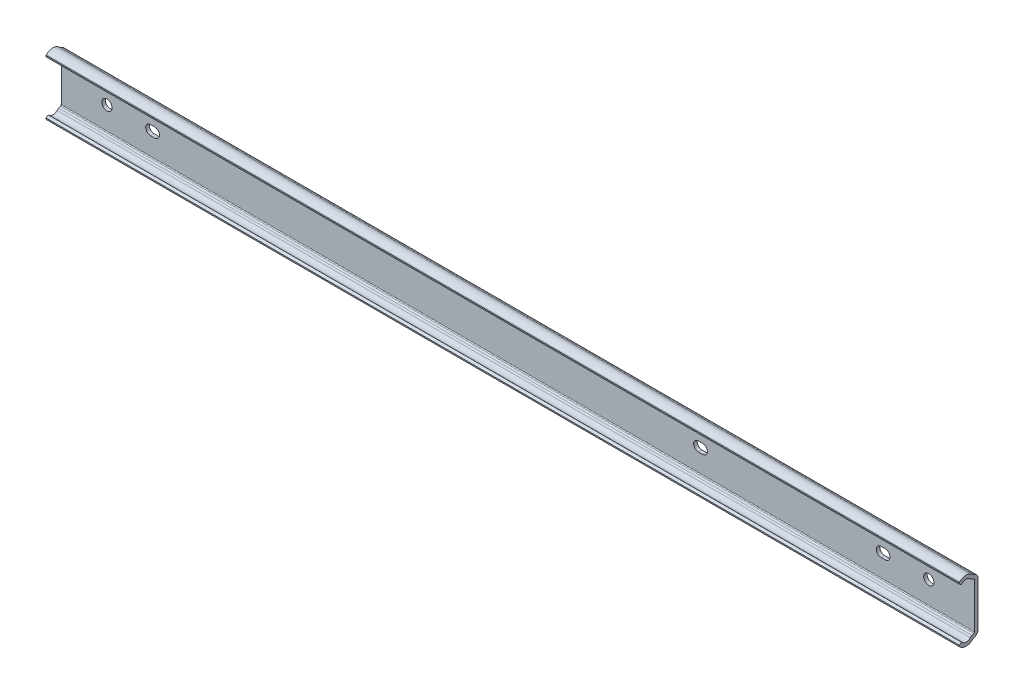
ISO-10303-21;
HEADER;
FILE_DESCRIPTION(('STEP AP214'),'2;1');
FILE_NAME('part.step','',(''),(''),'','','');
FILE_SCHEMA(('AUTOMOTIVE_DESIGN { 1 0 10303 214 1 1 1 1 }'));
ENDSEC;
DATA;
#1=APPLICATION_CONTEXT('core data for automotive mechanical design processes');
#2=APPLICATION_PROTOCOL_DEFINITION('international standard','automotive_design',2000,#1);
#3=PRODUCT_CONTEXT('',#1,'mechanical');
#4=PRODUCT('Part','Part','',(#3));
#5=PRODUCT_RELATED_PRODUCT_CATEGORY('part','',(#4));
#6=PRODUCT_DEFINITION_FORMATION('','',#4);
#7=PRODUCT_DEFINITION_CONTEXT('part definition',#1,'design');
#8=PRODUCT_DEFINITION('design','',#6,#7);
#9=PRODUCT_DEFINITION_SHAPE('','',#8);
#10=(LENGTH_UNIT() NAMED_UNIT(*) SI_UNIT(.MILLI.,.METRE.));
#11=(NAMED_UNIT(*) PLANE_ANGLE_UNIT() SI_UNIT($,.RADIAN.));
#12=(NAMED_UNIT(*) SI_UNIT($,.STERADIAN.) SOLID_ANGLE_UNIT());
#13=UNCERTAINTY_MEASURE_WITH_UNIT(LENGTH_MEASURE(1.E-05),#10,'distance_accuracy_value','');
#14=(GEOMETRIC_REPRESENTATION_CONTEXT(3) GLOBAL_UNCERTAINTY_ASSIGNED_CONTEXT((#13)) GLOBAL_UNIT_ASSIGNED_CONTEXT((#10,
#11,#12)) REPRESENTATION_CONTEXT('',''));
#15=CARTESIAN_POINT('',(0.,0.,0.));
#16=DIRECTION('',(0.,0.,1.));
#17=DIRECTION('',(1.,0.,0.));
#18=AXIS2_PLACEMENT_3D('',#15,#16,#17);
#19=CARTESIAN_POINT('',(-20.,9.85313395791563,1.54999999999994));
#20=DIRECTION('',(0.,0.,1.));
#21=DIRECTION('',(-1.,0.,0.));
#22=AXIS2_PLACEMENT_3D('',#19,#20,#21);
#23=PLANE('',#22);
#24=DIRECTION('',(0.,-1.,0.));
#25=VECTOR('',#24,1.);
#26=CARTESIAN_POINT('',(-20.,9.85313395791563,1.54999999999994));
#27=LINE('',#26,#25);
#28=CARTESIAN_POINT('',(-20.,9.85313395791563,1.54999999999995));
#29=VERTEX_POINT('',#28);
#30=CARTESIAN_POINT('',(-20.,-9.85313395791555,1.54999999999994));
#31=VERTEX_POINT('',#30);
#32=EDGE_CURVE('E510',#29,#31,#27,.T.);
#33=ORIENTED_EDGE('',*,*,#32,.T.);
#34=DIRECTION('',(1.,0.,0.));
#35=VECTOR('',#34,1.);
#36=CARTESIAN_POINT('',(-20.,-9.85313395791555,1.54999999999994));
#37=LINE('',#36,#35);
#38=CARTESIAN_POINT('',(380.,-9.85313395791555,1.54999999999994));
#39=VERTEX_POINT('',#38);
#40=EDGE_CURVE('E524',#31,#39,#37,.T.);
#41=ORIENTED_EDGE('',*,*,#40,.T.);
#42=DIRECTION('',(0.,-1.,0.));
#43=VECTOR('',#42,1.);
#44=CARTESIAN_POINT('',(380.,9.85313395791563,1.54999999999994));
#45=LINE('',#44,#43);
#46=CARTESIAN_POINT('',(380.,9.85313395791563,1.54999999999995));
#47=VERTEX_POINT('',#46);
#48=EDGE_CURVE('E435',#47,#39,#45,.T.);
#49=ORIENTED_EDGE('',*,*,#48,.F.);
#50=DIRECTION('',(1.,0.,0.));
#51=VECTOR('',#50,1.);
#52=CARTESIAN_POINT('',(-20.,9.85313395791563,1.54999999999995));
#53=LINE('',#52,#51);
#54=EDGE_CURVE('E526',#29,#47,#53,.T.);
#55=ORIENTED_EDGE('',*,*,#54,.F.);
#56=EDGE_LOOP('',(#33,#41,#49,#55));
#57=FACE_BOUND('',#56,.T.);
#58=CARTESIAN_POINT('',(20.9,0.,1.54999999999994));
#59=DIRECTION('',(0.,0.,1.));
#60=DIRECTION('',(-1.,0.,0.));
#61=AXIS2_PLACEMENT_3D('',#58,#59,#60);
#62=CIRCLE('',#61,2.1);
#63=CARTESIAN_POINT('',(20.9,-2.1,1.54999999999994));
#64=VERTEX_POINT('',#63);
#65=CARTESIAN_POINT('',(20.9,2.1,1.54999999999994));
#66=VERTEX_POINT('',#65);
#67=EDGE_CURVE('E31',#64,#66,#62,.T.);
#68=ORIENTED_EDGE('',*,*,#67,.F.);
#69=DIRECTION('',(1.,0.,0.));
#70=VECTOR('',#69,1.);
#71=CARTESIAN_POINT('',(20.9,-2.1,1.54999999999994));
#72=LINE('',#71,#70);
#73=CARTESIAN_POINT('',(19.1,-2.1,1.54999999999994));
#74=VERTEX_POINT('',#73);
#75=EDGE_CURVE('E277',#74,#64,#72,.T.);
#76=ORIENTED_EDGE('',*,*,#75,.F.);
#77=CARTESIAN_POINT('',(19.1,0.,1.54999999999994));
#78=DIRECTION('',(0.,0.,1.));
#79=DIRECTION('',(-1.,0.,0.));
#80=AXIS2_PLACEMENT_3D('',#77,#78,#79);
#81=CIRCLE('',#80,2.1);
#82=CARTESIAN_POINT('',(19.1,2.1,1.54999999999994));
#83=VERTEX_POINT('',#82);
#84=EDGE_CURVE('E262',#83,#74,#81,.T.);
#85=ORIENTED_EDGE('',*,*,#84,.F.);
#86=DIRECTION('',(-1.,0.,0.));
#87=VECTOR('',#86,1.);
#88=CARTESIAN_POINT('',(20.9,2.1,1.54999999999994));
#89=LINE('',#88,#87);
#90=EDGE_CURVE('E271',#66,#83,#89,.T.);
#91=ORIENTED_EDGE('',*,*,#90,.F.);
#92=EDGE_LOOP('',(#68,#76,#85,#91));
#93=FACE_BOUND('',#92,.T.);
#94=CARTESIAN_POINT('',(260.9,0.,1.54999999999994));
#95=DIRECTION('',(0.,0.,1.));
#96=DIRECTION('',(-1.,0.,0.));
#97=AXIS2_PLACEMENT_3D('',#94,#95,#96);
#98=CIRCLE('',#97,2.1);
#99=CARTESIAN_POINT('',(260.9,-2.09999999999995,1.54999999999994));
#100=VERTEX_POINT('',#99);
#101=CARTESIAN_POINT('',(260.9,2.10000000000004,1.54999999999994));
#102=VERTEX_POINT('',#101);
#103=EDGE_CURVE('E293',#100,#102,#98,.T.);
#104=ORIENTED_EDGE('',*,*,#103,.F.);
#105=DIRECTION('',(1.,0.,0.));
#106=VECTOR('',#105,1.);
#107=CARTESIAN_POINT('',(260.9,-2.09999999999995,1.54999999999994));
#108=LINE('',#107,#106);
#109=CARTESIAN_POINT('',(259.1,-2.09999999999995,1.54999999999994));
#110=VERTEX_POINT('',#109);
#111=EDGE_CURVE('E303',#110,#100,#108,.T.);
#112=ORIENTED_EDGE('',*,*,#111,.F.);
#113=CARTESIAN_POINT('',(259.1,0.,1.54999999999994));
#114=DIRECTION('',(0.,0.,1.));
#115=DIRECTION('',(-1.,0.,0.));
#116=AXIS2_PLACEMENT_3D('',#113,#114,#115);
#117=CIRCLE('',#116,2.1);
#118=CARTESIAN_POINT('',(259.1,2.10000000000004,1.54999999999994));
#119=VERTEX_POINT('',#118);
#120=EDGE_CURVE('E300',#119,#110,#117,.T.);
#121=ORIENTED_EDGE('',*,*,#120,.F.);
#122=DIRECTION('',(-1.,0.,0.));
#123=VECTOR('',#122,1.);
#124=CARTESIAN_POINT('',(260.9,2.10000000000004,1.54999999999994));
#125=LINE('',#124,#123);
#126=EDGE_CURVE('E297',#102,#119,#125,.T.);
#127=ORIENTED_EDGE('',*,*,#126,.F.);
#128=EDGE_LOOP('',(#104,#112,#121,#127));
#129=FACE_BOUND('',#128,.T.);
#130=CARTESIAN_POINT('',(360.,0.,1.54999999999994));
#131=DIRECTION('',(0.,0.,1.));
#132=DIRECTION('',(-1.,0.,0.));
#133=AXIS2_PLACEMENT_3D('',#130,#131,#132);
#134=CIRCLE('',#133,2.24999999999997);
#135=CARTESIAN_POINT('',(357.75,0.,1.54999999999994));
#136=VERTEX_POINT('',#135);
#137=EDGE_CURVE('E321',#136,#136,#134,.T.);
#138=ORIENTED_EDGE('',*,*,#137,.F.);
#139=EDGE_LOOP('',(#138));
#140=FACE_BOUND('',#139,.T.);
#141=CARTESIAN_POINT('',(0.,0.,1.54999999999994));
#142=DIRECTION('',(0.,0.,1.));
#143=DIRECTION('',(-1.,0.,0.));
#144=AXIS2_PLACEMENT_3D('',#141,#142,#143);
#145=CIRCLE('',#144,2.24999999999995);
#146=CARTESIAN_POINT('',(-2.24999999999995,0.,1.54999999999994));
#147=VERTEX_POINT('',#146);
#148=EDGE_CURVE('E333',#147,#147,#145,.T.);
#149=ORIENTED_EDGE('',*,*,#148,.F.);
#150=EDGE_LOOP('',(#149));
#151=FACE_BOUND('',#150,.T.);
#152=CARTESIAN_POINT('',(339.1,0.,1.54999999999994));
#153=DIRECTION('',(0.,0.,1.));
#154=DIRECTION('',(-1.,0.,0.));
#155=AXIS2_PLACEMENT_3D('',#152,#153,#154);
#156=CIRCLE('',#155,2.1);
#157=CARTESIAN_POINT('',(339.1,2.10000000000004,1.54999999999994));
#158=VERTEX_POINT('',#157);
#159=CARTESIAN_POINT('',(339.1,-2.09999999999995,1.54999999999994));
#160=VERTEX_POINT('',#159);
#161=EDGE_CURVE('E339',#158,#160,#156,.T.);
#162=ORIENTED_EDGE('',*,*,#161,.F.);
#163=DIRECTION('',(-1.,0.,0.));
#164=VECTOR('',#163,1.);
#165=CARTESIAN_POINT('',(340.9,2.10000000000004,1.54999999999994));
#166=LINE('',#165,#164);
#167=CARTESIAN_POINT('',(340.9,2.10000000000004,1.54999999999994));
#168=VERTEX_POINT('',#167);
#169=EDGE_CURVE('E347',#168,#158,#166,.T.);
#170=ORIENTED_EDGE('',*,*,#169,.F.);
#171=CARTESIAN_POINT('',(340.9,0.,1.54999999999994));
#172=DIRECTION('',(0.,0.,1.));
#173=DIRECTION('',(-1.,0.,0.));
#174=AXIS2_PLACEMENT_3D('',#171,#172,#173);
#175=CIRCLE('',#174,2.1);
#176=CARTESIAN_POINT('',(340.9,-2.09999999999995,1.54999999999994));
#177=VERTEX_POINT('',#176);
#178=EDGE_CURVE('E344',#177,#168,#175,.T.);
#179=ORIENTED_EDGE('',*,*,#178,.F.);
#180=DIRECTION('',(1.,0.,0.));
#181=VECTOR('',#180,1.);
#182=CARTESIAN_POINT('',(340.9,-2.09999999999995,1.54999999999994));
#183=LINE('',#182,#181);
#184=EDGE_CURVE('E341',#160,#177,#183,.T.);
#185=ORIENTED_EDGE('',*,*,#184,.F.);
#186=EDGE_LOOP('',(#162,#170,#179,#185));
#187=FACE_BOUND('',#186,.T.);
#188=ADVANCED_FACE('F14',(#57,#93,#129,#140,#151,#187),#23,.T.);
#189=CARTESIAN_POINT('',(-20.,9.85313395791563,0.));
#190=DIRECTION('',(0.,0.,-1.));
#191=DIRECTION('',(1.,0.,0.));
#192=AXIS2_PLACEMENT_3D('',#189,#190,#191);
#193=PLANE('',#192);
#194=DIRECTION('',(0.,1.,0.));
#195=VECTOR('',#194,1.);
#196=CARTESIAN_POINT('',(-20.,9.85313395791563,0.));
#197=LINE('',#196,#195);
#198=CARTESIAN_POINT('',(-20.,-9.85313395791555,0.));
#199=VERTEX_POINT('',#198);
#200=CARTESIAN_POINT('',(-20.,9.85313395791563,0.));
#201=VERTEX_POINT('',#200);
#202=EDGE_CURVE('E473',#199,#201,#197,.T.);
#203=ORIENTED_EDGE('',*,*,#202,.T.);
#204=DIRECTION('',(1.,0.,0.));
#205=VECTOR('',#204,1.);
#206=CARTESIAN_POINT('',(-20.,9.85313395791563,0.));
#207=LINE('',#206,#205);
#208=CARTESIAN_POINT('',(380.,9.85313395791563,0.));
#209=VERTEX_POINT('',#208);
#210=EDGE_CURVE('E551',#201,#209,#207,.T.);
#211=ORIENTED_EDGE('',*,*,#210,.T.);
#212=DIRECTION('',(0.,1.,0.));
#213=VECTOR('',#212,1.);
#214=CARTESIAN_POINT('',(380.,9.85313395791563,0.));
#215=LINE('',#214,#213);
#216=CARTESIAN_POINT('',(380.,-9.85313395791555,0.));
#217=VERTEX_POINT('',#216);
#218=EDGE_CURVE('E397',#217,#209,#215,.T.);
#219=ORIENTED_EDGE('',*,*,#218,.F.);
#220=DIRECTION('',(1.,0.,0.));
#221=VECTOR('',#220,1.);
#222=CARTESIAN_POINT('',(-20.,-9.85313395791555,0.));
#223=LINE('',#222,#221);
#224=EDGE_CURVE('E553',#199,#217,#223,.T.);
#225=ORIENTED_EDGE('',*,*,#224,.F.);
#226=EDGE_LOOP('',(#203,#211,#219,#225));
#227=FACE_BOUND('',#226,.T.);
#228=CARTESIAN_POINT('',(20.9,0.,0.));
#229=DIRECTION('',(0.,0.,1.));
#230=DIRECTION('',(-1.,0.,0.));
#231=AXIS2_PLACEMENT_3D('',#228,#229,#230);
#232=CIRCLE('',#231,2.1);
#233=CARTESIAN_POINT('',(20.9,-2.1,0.));
#234=VERTEX_POINT('',#233);
#235=CARTESIAN_POINT('',(20.9,2.1,0.));
#236=VERTEX_POINT('',#235);
#237=EDGE_CURVE('E279',#234,#236,#232,.T.);
#238=ORIENTED_EDGE('',*,*,#237,.T.);
#239=DIRECTION('',(-1.,0.,0.));
#240=VECTOR('',#239,1.);
#241=CARTESIAN_POINT('',(20.9,2.1,0.));
#242=LINE('',#241,#240);
#243=CARTESIAN_POINT('',(19.1,2.1,0.));
#244=VERTEX_POINT('',#243);
#245=EDGE_CURVE('E285',#236,#244,#242,.T.);
#246=ORIENTED_EDGE('',*,*,#245,.T.);
#247=CARTESIAN_POINT('',(19.1,0.,0.));
#248=DIRECTION('',(0.,0.,1.));
#249=DIRECTION('',(-1.,0.,0.));
#250=AXIS2_PLACEMENT_3D('',#247,#248,#249);
#251=CIRCLE('',#250,2.1);
#252=CARTESIAN_POINT('',(19.1,-2.1,0.));
#253=VERTEX_POINT('',#252);
#254=EDGE_CURVE('E39',#244,#253,#251,.T.);
#255=ORIENTED_EDGE('',*,*,#254,.T.);
#256=DIRECTION('',(1.,0.,0.));
#257=VECTOR('',#256,1.);
#258=CARTESIAN_POINT('',(20.9,-2.1,0.));
#259=LINE('',#258,#257);
#260=EDGE_CURVE('E288',#253,#234,#259,.T.);
#261=ORIENTED_EDGE('',*,*,#260,.T.);
#262=EDGE_LOOP('',(#238,#246,#255,#261));
#263=FACE_BOUND('',#262,.T.);
#264=CARTESIAN_POINT('',(260.9,0.,0.));
#265=DIRECTION('',(0.,0.,1.));
#266=DIRECTION('',(-1.,0.,0.));
#267=AXIS2_PLACEMENT_3D('',#264,#265,#266);
#268=CIRCLE('',#267,2.1);
#269=CARTESIAN_POINT('',(260.9,-2.09999999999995,0.));
#270=VERTEX_POINT('',#269);
#271=CARTESIAN_POINT('',(260.9,2.10000000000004,0.));
#272=VERTEX_POINT('',#271);
#273=EDGE_CURVE('E306',#270,#272,#268,.T.);
#274=ORIENTED_EDGE('',*,*,#273,.T.);
#275=DIRECTION('',(-1.,0.,0.));
#276=VECTOR('',#275,1.);
#277=CARTESIAN_POINT('',(260.9,2.10000000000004,0.));
#278=LINE('',#277,#276);
#279=CARTESIAN_POINT('',(259.1,2.10000000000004,0.));
#280=VERTEX_POINT('',#279);
#281=EDGE_CURVE('E309',#272,#280,#278,.T.);
#282=ORIENTED_EDGE('',*,*,#281,.T.);
#283=CARTESIAN_POINT('',(259.1,0.,0.));
#284=DIRECTION('',(0.,0.,1.));
#285=DIRECTION('',(-1.,0.,0.));
#286=AXIS2_PLACEMENT_3D('',#283,#284,#285);
#287=CIRCLE('',#286,2.1);
#288=CARTESIAN_POINT('',(259.1,-2.09999999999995,0.));
#289=VERTEX_POINT('',#288);
#290=EDGE_CURVE('E312',#280,#289,#287,.T.);
#291=ORIENTED_EDGE('',*,*,#290,.T.);
#292=DIRECTION('',(1.,0.,0.));
#293=VECTOR('',#292,1.);
#294=CARTESIAN_POINT('',(260.9,-2.09999999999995,0.));
#295=LINE('',#294,#293);
#296=EDGE_CURVE('E315',#289,#270,#295,.T.);
#297=ORIENTED_EDGE('',*,*,#296,.T.);
#298=EDGE_LOOP('',(#274,#282,#291,#297));
#299=FACE_BOUND('',#298,.T.);
#300=CARTESIAN_POINT('',(360.,0.,0.));
#301=DIRECTION('',(0.,0.,1.));
#302=DIRECTION('',(-1.,0.,0.));
#303=AXIS2_PLACEMENT_3D('',#300,#301,#302);
#304=CIRCLE('',#303,2.24999999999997);
#305=CARTESIAN_POINT('',(357.75,0.,0.));
#306=VERTEX_POINT('',#305);
#307=EDGE_CURVE('E330',#306,#306,#304,.T.);
#308=ORIENTED_EDGE('',*,*,#307,.T.);
#309=EDGE_LOOP('',(#308));
#310=FACE_BOUND('',#309,.T.);
#311=CARTESIAN_POINT('',(0.,0.,0.));
#312=DIRECTION('',(0.,0.,1.));
#313=DIRECTION('',(-1.,0.,0.));
#314=AXIS2_PLACEMENT_3D('',#311,#312,#313);
#315=CIRCLE('',#314,2.24999999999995);
#316=CARTESIAN_POINT('',(-2.24999999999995,0.,0.));
#317=VERTEX_POINT('',#316);
#318=EDGE_CURVE('E336',#317,#317,#315,.T.);
#319=ORIENTED_EDGE('',*,*,#318,.T.);
#320=EDGE_LOOP('',(#319));
#321=FACE_BOUND('',#320,.T.);
#322=CARTESIAN_POINT('',(339.1,0.,0.));
#323=DIRECTION('',(0.,0.,1.));
#324=DIRECTION('',(-1.,0.,0.));
#325=AXIS2_PLACEMENT_3D('',#322,#323,#324);
#326=CIRCLE('',#325,2.1);
#327=CARTESIAN_POINT('',(339.1,2.10000000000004,0.));
#328=VERTEX_POINT('',#327);
#329=CARTESIAN_POINT('',(339.1,-2.09999999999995,0.));
#330=VERTEX_POINT('',#329);
#331=EDGE_CURVE('E350',#328,#330,#326,.T.);
#332=ORIENTED_EDGE('',*,*,#331,.T.);
#333=DIRECTION('',(1.,0.,0.));
#334=VECTOR('',#333,1.);
#335=CARTESIAN_POINT('',(340.9,-2.09999999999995,0.));
#336=LINE('',#335,#334);
#337=CARTESIAN_POINT('',(340.9,-2.09999999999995,0.));
#338=VERTEX_POINT('',#337);
#339=EDGE_CURVE('E353',#330,#338,#336,.T.);
#340=ORIENTED_EDGE('',*,*,#339,.T.);
#341=CARTESIAN_POINT('',(340.9,0.,0.));
#342=DIRECTION('',(0.,0.,1.));
#343=DIRECTION('',(-1.,0.,0.));
#344=AXIS2_PLACEMENT_3D('',#341,#342,#343);
#345=CIRCLE('',#344,2.1);
#346=CARTESIAN_POINT('',(340.9,2.10000000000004,0.));
#347=VERTEX_POINT('',#346);
#348=EDGE_CURVE('E356',#338,#347,#345,.T.);
#349=ORIENTED_EDGE('',*,*,#348,.T.);
#350=DIRECTION('',(-1.,0.,0.));
#351=VECTOR('',#350,1.);
#352=CARTESIAN_POINT('',(340.9,2.10000000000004,0.));
#353=LINE('',#352,#351);
#354=EDGE_CURVE('E359',#347,#328,#353,.T.);
#355=ORIENTED_EDGE('',*,*,#354,.T.);
#356=EDGE_LOOP('',(#332,#340,#349,#355));
#357=FACE_BOUND('',#356,.T.);
#358=ADVANCED_FACE('F618',(#227,#263,#299,#310,#321,#357),#193,.T.);
#359=CARTESIAN_POINT('',(-20.,-9.46999976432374,5.19000022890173));
#360=DIRECTION('',(1.,0.,0.));
#361=DIRECTION('',(0.,0.,1.));
#362=AXIS2_PLACEMENT_3D('',#359,#360,#361);
#363=CYLINDRICAL_SURFACE('',#362,2.47999999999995);
#364=CARTESIAN_POINT('',(380.,-9.46999976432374,5.19000022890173));
#365=DIRECTION('',(-1.,0.,0.));
#366=DIRECTION('',(0.,0.,1.));
#367=AXIS2_PLACEMENT_3D('',#364,#365,#366);
#368=CIRCLE('',#367,2.47999999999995);
#369=CARTESIAN_POINT('',(380.,-11.1527317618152,3.3682392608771));
#370=VERTEX_POINT('',#369);
#371=CARTESIAN_POINT('',(380.,-11.2236245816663,6.94362504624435));
#372=VERTEX_POINT('',#371);
#373=EDGE_CURVE('E365',#370,#372,#368,.T.);
#374=ORIENTED_EDGE('',*,*,#373,.F.);
#375=DIRECTION('',(1.,0.,0.));
#376=VECTOR('',#375,1.);
#377=CARTESIAN_POINT('',(-20.,-11.1527317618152,3.3682392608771));
#378=LINE('',#377,#376);
#379=CARTESIAN_POINT('',(-20.,-11.1527317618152,3.3682392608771));
#380=VERTEX_POINT('',#379);
#381=EDGE_CURVE('E9',#380,#370,#378,.T.);
#382=ORIENTED_EDGE('',*,*,#381,.F.);
#383=CARTESIAN_POINT('',(-20.,-9.46999976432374,5.19000022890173));
#384=DIRECTION('',(-1.,0.,0.));
#385=DIRECTION('',(0.,0.,1.));
#386=AXIS2_PLACEMENT_3D('',#383,#384,#385);
#387=CIRCLE('',#386,2.47999999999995);
#388=CARTESIAN_POINT('',(-20.,-11.2236245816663,6.94362504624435));
#389=VERTEX_POINT('',#388);
#390=EDGE_CURVE('E447',#380,#389,#387,.T.);
#391=ORIENTED_EDGE('',*,*,#390,.T.);
#392=DIRECTION('',(1.,0.,0.));
#393=VECTOR('',#392,1.);
#394=CARTESIAN_POINT('',(-20.,-11.2236245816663,6.94362504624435));
#395=LINE('',#394,#393);
#396=EDGE_CURVE('E18',#389,#372,#395,.T.);
#397=ORIENTED_EDGE('',*,*,#396,.T.);
#398=EDGE_LOOP('',(#374,#382,#391,#397));
#399=FACE_BOUND('',#398,.T.);
#400=ADVANCED_FACE('F16',(#399),#363,.F.);
#401=CARTESIAN_POINT('',(-20.,-12.5436997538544,1.86234824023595));
#402=DIRECTION('',(1.,0.,0.));
#403=DIRECTION('',(0.,0.,1.));
#404=AXIS2_PLACEMENT_3D('',#401,#402,#403);
#405=CYLINDRICAL_SURFACE('',#404,2.04999993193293);
#406=CARTESIAN_POINT('',(380.,-12.5436997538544,1.86234824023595));
#407=DIRECTION('',(1.,0.,0.));
#408=DIRECTION('',(0.,0.,1.));
#409=AXIS2_PLACEMENT_3D('',#406,#407,#408);
#410=CIRCLE('',#409,2.04999993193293);
#411=CARTESIAN_POINT('',(380.,-10.6566648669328,2.66334702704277));
#412=VERTEX_POINT('',#411);
#413=EDGE_CURVE('E444',#412,#370,#410,.T.);
#414=ORIENTED_EDGE('',*,*,#413,.F.);
#415=DIRECTION('',(1.,0.,0.));
#416=VECTOR('',#415,1.);
#417=CARTESIAN_POINT('',(-20.,-10.6566648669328,2.66334702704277));
#418=LINE('',#417,#416);
#419=CARTESIAN_POINT('',(-20.,-10.6566648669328,2.66334702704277));
#420=VERTEX_POINT('',#419);
#421=EDGE_CURVE('E23',#420,#412,#418,.T.);
#422=ORIENTED_EDGE('',*,*,#421,.F.);
#423=CARTESIAN_POINT('',(-20.,-12.5436997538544,1.86234824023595));
#424=DIRECTION('',(1.,0.,0.));
#425=DIRECTION('',(0.,0.,1.));
#426=AXIS2_PLACEMENT_3D('',#423,#424,#425);
#427=CIRCLE('',#426,2.04999993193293);
#428=EDGE_CURVE('E518',#420,#380,#427,.T.);
#429=ORIENTED_EDGE('',*,*,#428,.T.);
#430=ORIENTED_EDGE('',*,*,#381,.T.);
#431=EDGE_LOOP('',(#414,#422,#429,#430));
#432=FACE_BOUND('',#431,.T.);
#433=ADVANCED_FACE('F581',(#432),#405,.T.);
#434=CARTESIAN_POINT('',(-20.,-10.6566648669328,2.66334702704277));
#435=DIRECTION('',(0.,0.920504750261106,0.390731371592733));
#436=DIRECTION('',(0.,-0.390731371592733,0.920504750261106));
#437=AXIS2_PLACEMENT_3D('',#434,#435,#436);
#438=PLANE('',#437);
#439=DIRECTION('',(0.,-0.390731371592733,0.920504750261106));
#440=VECTOR('',#439,1.);
#441=CARTESIAN_POINT('',(380.,-10.6566648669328,2.66334702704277));
#442=LINE('',#441,#440);
#443=CARTESIAN_POINT('',(380.,-10.3133868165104,1.85463521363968));
#444=VERTEX_POINT('',#443);
#445=EDGE_CURVE('E441',#444,#412,#442,.T.);
#446=ORIENTED_EDGE('',*,*,#445,.F.);
#447=DIRECTION('',(1.,0.,0.));
#448=VECTOR('',#447,1.);
#449=CARTESIAN_POINT('',(-20.,-10.3133868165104,1.85463521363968));
#450=LINE('',#449,#448);
#451=CARTESIAN_POINT('',(-20.,-10.3133868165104,1.85463521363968));
#452=VERTEX_POINT('',#451);
#453=EDGE_CURVE('E522',#452,#444,#450,.T.);
#454=ORIENTED_EDGE('',*,*,#453,.F.);
#455=DIRECTION('',(0.,-0.390731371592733,0.920504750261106));
#456=VECTOR('',#455,1.);
#457=CARTESIAN_POINT('',(-20.,-10.6566648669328,2.66334702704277));
#458=LINE('',#457,#456);
#459=EDGE_CURVE('E515',#452,#420,#458,.T.);
#460=ORIENTED_EDGE('',*,*,#459,.T.);
#461=ORIENTED_EDGE('',*,*,#421,.T.);
#462=EDGE_LOOP('',(#446,#454,#460,#461));
#463=FACE_BOUND('',#462,.T.);
#464=ADVANCED_FACE('F678',(#463),#438,.T.);
#465=CARTESIAN_POINT('',(-20.,-9.85313395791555,2.05000015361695));
#466=DIRECTION('',(1.,0.,0.));
#467=DIRECTION('',(0.,0.,1.));
#468=AXIS2_PLACEMENT_3D('',#465,#466,#467);
#469=CYLINDRICAL_SURFACE('',#468,0.500000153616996);
#470=CARTESIAN_POINT('',(380.,-9.85313395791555,2.05000015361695));
#471=DIRECTION('',(-1.,0.,0.));
#472=DIRECTION('',(0.,0.,1.));
#473=AXIS2_PLACEMENT_3D('',#470,#471,#472);
#474=CIRCLE('',#473,0.500000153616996);
#475=EDGE_CURVE('E438',#39,#444,#474,.T.);
#476=ORIENTED_EDGE('',*,*,#475,.F.);
#477=ORIENTED_EDGE('',*,*,#40,.F.);
#478=CARTESIAN_POINT('',(-20.,-9.85313395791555,2.05000015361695));
#479=DIRECTION('',(-1.,0.,0.));
#480=DIRECTION('',(0.,0.,1.));
#481=AXIS2_PLACEMENT_3D('',#478,#479,#480);
#482=CIRCLE('',#481,0.500000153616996);
#483=EDGE_CURVE('E512',#31,#452,#482,.T.);
#484=ORIENTED_EDGE('',*,*,#483,.T.);
#485=ORIENTED_EDGE('',*,*,#453,.T.);
#486=EDGE_LOOP('',(#476,#477,#484,#485));
#487=FACE_BOUND('',#486,.T.);
#488=ADVANCED_FACE('F676',(#487),#469,.F.);
#489=CARTESIAN_POINT('',(-20.,9.85313395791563,2.05000015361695));
#490=DIRECTION('',(1.,0.,0.));
#491=DIRECTION('',(0.,0.,1.));
#492=AXIS2_PLACEMENT_3D('',#489,#490,#491);
#493=CYLINDRICAL_SURFACE('',#492,0.500000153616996);
#494=CARTESIAN_POINT('',(380.,9.85313395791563,2.05000015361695));
#495=DIRECTION('',(-1.,0.,0.));
#496=DIRECTION('',(0.,0.,-1.));
#497=AXIS2_PLACEMENT_3D('',#494,#495,#496);
#498=CIRCLE('',#497,0.500000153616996);
#499=CARTESIAN_POINT('',(380.,10.3133868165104,1.85463521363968));
#500=VERTEX_POINT('',#499);
#501=EDGE_CURVE('E432',#500,#47,#498,.T.);
#502=ORIENTED_EDGE('',*,*,#501,.F.);
#503=DIRECTION('',(1.,0.,0.));
#504=VECTOR('',#503,1.);
#505=CARTESIAN_POINT('',(-20.,10.3133868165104,1.85463521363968));
#506=LINE('',#505,#504);
#507=CARTESIAN_POINT('',(-20.,10.3133868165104,1.85463521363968));
#508=VERTEX_POINT('',#507);
#509=EDGE_CURVE('E528',#508,#500,#506,.T.);
#510=ORIENTED_EDGE('',*,*,#509,.F.);
#511=CARTESIAN_POINT('',(-20.,9.85313395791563,2.05000015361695));
#512=DIRECTION('',(-1.,0.,0.));
#513=DIRECTION('',(0.,0.,-1.));
#514=AXIS2_PLACEMENT_3D('',#511,#512,#513);
#515=CIRCLE('',#514,0.500000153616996);
#516=EDGE_CURVE('E507',#508,#29,#515,.T.);
#517=ORIENTED_EDGE('',*,*,#516,.T.);
#518=ORIENTED_EDGE('',*,*,#54,.T.);
#519=EDGE_LOOP('',(#502,#510,#517,#518));
#520=FACE_BOUND('',#519,.T.);
#521=ADVANCED_FACE('F668',(#520),#493,.F.);
#522=CARTESIAN_POINT('',(-20.,10.6566648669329,2.66334702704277));
#523=DIRECTION('',(0.,-0.920504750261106,0.390731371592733));
#524=DIRECTION('',(0.,-0.390731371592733,-0.920504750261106));
#525=AXIS2_PLACEMENT_3D('',#522,#523,#524);
#526=PLANE('',#525);
#527=DIRECTION('',(0.,-0.390731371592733,-0.920504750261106));
#528=VECTOR('',#527,1.);
#529=CARTESIAN_POINT('',(380.,10.6566648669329,2.66334702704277));
#530=LINE('',#529,#528);
#531=CARTESIAN_POINT('',(380.,10.6566648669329,2.66334702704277));
#532=VERTEX_POINT('',#531);
#533=EDGE_CURVE('E429',#532,#500,#530,.T.);
#534=ORIENTED_EDGE('',*,*,#533,.F.);
#535=DIRECTION('',(1.,0.,0.));
#536=VECTOR('',#535,1.);
#537=CARTESIAN_POINT('',(-20.,10.6566648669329,2.66334702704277));
#538=LINE('',#537,#536);
#539=CARTESIAN_POINT('',(-20.,10.6566648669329,2.66334702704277));
#540=VERTEX_POINT('',#539);
#541=EDGE_CURVE('E530',#540,#532,#538,.T.);
#542=ORIENTED_EDGE('',*,*,#541,.F.);
#543=DIRECTION('',(0.,-0.390731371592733,-0.920504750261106));
#544=VECTOR('',#543,1.);
#545=CARTESIAN_POINT('',(-20.,10.6566648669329,2.66334702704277));
#546=LINE('',#545,#544);
#547=EDGE_CURVE('E504',#540,#508,#546,.T.);
#548=ORIENTED_EDGE('',*,*,#547,.T.);
#549=ORIENTED_EDGE('',*,*,#509,.T.);
#550=EDGE_LOOP('',(#534,#542,#548,#549));
#551=FACE_BOUND('',#550,.T.);
#552=ADVANCED_FACE('F664',(#551),#526,.T.);
#553=CARTESIAN_POINT('',(-20.,12.5436997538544,1.86234824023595));
#554=DIRECTION('',(1.,0.,0.));
#555=DIRECTION('',(0.,0.,1.));
#556=AXIS2_PLACEMENT_3D('',#553,#554,#555);
#557=CYLINDRICAL_SURFACE('',#556,2.04999993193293);
#558=CARTESIAN_POINT('',(380.,12.5436997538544,1.86234824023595));
#559=DIRECTION('',(1.,0.,0.));
#560=DIRECTION('',(0.,0.,-1.));
#561=AXIS2_PLACEMENT_3D('',#558,#559,#560);
#562=CIRCLE('',#561,2.04999993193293);
#563=CARTESIAN_POINT('',(380.,11.1527317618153,3.36823926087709));
#564=VERTEX_POINT('',#563);
#565=EDGE_CURVE('E426',#564,#532,#562,.T.);
#566=ORIENTED_EDGE('',*,*,#565,.F.);
#567=DIRECTION('',(1.,0.,0.));
#568=VECTOR('',#567,1.);
#569=CARTESIAN_POINT('',(-20.,11.1527317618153,3.36823926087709));
#570=LINE('',#569,#568);
#571=CARTESIAN_POINT('',(-20.,11.1527317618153,3.36823926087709));
#572=VERTEX_POINT('',#571);
#573=EDGE_CURVE('E532',#572,#564,#570,.T.);
#574=ORIENTED_EDGE('',*,*,#573,.F.);
#575=CARTESIAN_POINT('',(-20.,12.5436997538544,1.86234824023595));
#576=DIRECTION('',(1.,0.,0.));
#577=DIRECTION('',(0.,0.,-1.));
#578=AXIS2_PLACEMENT_3D('',#575,#576,#577);
#579=CIRCLE('',#578,2.04999993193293);
#580=EDGE_CURVE('E501',#572,#540,#579,.T.);
#581=ORIENTED_EDGE('',*,*,#580,.T.);
#582=ORIENTED_EDGE('',*,*,#541,.T.);
#583=EDGE_LOOP('',(#566,#574,#581,#582));
#584=FACE_BOUND('',#583,.T.);
#585=ADVANCED_FACE('F660',(#584),#557,.T.);
#586=CARTESIAN_POINT('',(-20.,9.46999976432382,5.19000022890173));
#587=DIRECTION('',(1.,0.,0.));
#588=DIRECTION('',(0.,0.,1.));
#589=AXIS2_PLACEMENT_3D('',#586,#587,#588);
#590=CYLINDRICAL_SURFACE('',#589,2.47999999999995);
#591=CARTESIAN_POINT('',(380.,9.46999976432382,5.19000022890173));
#592=DIRECTION('',(-1.,0.,0.));
#593=DIRECTION('',(0.,0.,-1.));
#594=AXIS2_PLACEMENT_3D('',#591,#592,#593);
#595=CIRCLE('',#594,2.47999999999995);
#596=CARTESIAN_POINT('',(380.,11.2236245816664,6.94362504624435));
#597=VERTEX_POINT('',#596);
#598=EDGE_CURVE('E423',#597,#564,#595,.T.);
#599=ORIENTED_EDGE('',*,*,#598,.F.);
#600=DIRECTION('',(1.,0.,0.));
#601=VECTOR('',#600,1.);
#602=CARTESIAN_POINT('',(-20.,11.2236245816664,6.94362504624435));
#603=LINE('',#602,#601);
#604=CARTESIAN_POINT('',(-20.,11.2236245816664,6.94362504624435));
#605=VERTEX_POINT('',#604);
#606=EDGE_CURVE('E534',#605,#597,#603,.T.);
#607=ORIENTED_EDGE('',*,*,#606,.F.);
#608=CARTESIAN_POINT('',(-20.,9.46999976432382,5.19000022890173));
#609=DIRECTION('',(-1.,0.,0.));
#610=DIRECTION('',(0.,0.,-1.));
#611=AXIS2_PLACEMENT_3D('',#608,#609,#610);
#612=CIRCLE('',#611,2.47999999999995);
#613=EDGE_CURVE('E498',#605,#572,#612,.T.);
#614=ORIENTED_EDGE('',*,*,#613,.T.);
#615=ORIENTED_EDGE('',*,*,#573,.T.);
#616=EDGE_LOOP('',(#599,#607,#614,#615));
#617=FACE_BOUND('',#616,.T.);
#618=ADVANCED_FACE('F656',(#617),#590,.F.);
#619=CARTESIAN_POINT('',(-20.,11.2236245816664,6.94362504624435));
#620=DIRECTION('',(0.,-0.707107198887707,-0.707106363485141));
#621=DIRECTION('',(0.,0.707106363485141,-0.707107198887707));
#622=AXIS2_PLACEMENT_3D('',#619,#620,#621);
#623=PLANE('',#622);
#624=DIRECTION('',(0.,0.707106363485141,-0.707107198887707));
#625=VECTOR('',#624,1.);
#626=CARTESIAN_POINT('',(380.,11.2236245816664,6.94362504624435));
#627=LINE('',#626,#625);
#628=CARTESIAN_POINT('',(380.,10.9144127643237,7.25283722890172));
#629=VERTEX_POINT('',#628);
#630=EDGE_CURVE('E420',#629,#597,#627,.T.);
#631=ORIENTED_EDGE('',*,*,#630,.F.);
#632=DIRECTION('',(1.,0.,0.));
#633=VECTOR('',#632,1.);
#634=CARTESIAN_POINT('',(-20.,10.9144127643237,7.25283722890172));
#635=LINE('',#634,#633);
#636=CARTESIAN_POINT('',(-20.,10.9144127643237,7.25283722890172));
#637=VERTEX_POINT('',#636);
#638=EDGE_CURVE('E536',#637,#629,#635,.T.);
#639=ORIENTED_EDGE('',*,*,#638,.F.);
#640=DIRECTION('',(0.,0.707106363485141,-0.707107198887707));
#641=VECTOR('',#640,1.);
#642=CARTESIAN_POINT('',(-20.,11.2236245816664,6.94362504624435));
#643=LINE('',#642,#641);
#644=EDGE_CURVE('E495',#637,#605,#643,.T.);
#645=ORIENTED_EDGE('',*,*,#644,.T.);
#646=ORIENTED_EDGE('',*,*,#606,.T.);
#647=EDGE_LOOP('',(#631,#639,#645,#646));
#648=FACE_BOUND('',#647,.T.);
#649=ADVANCED_FACE('F652',(#648),#623,.T.);
#650=CARTESIAN_POINT('',(-20.,10.9144127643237,7.25283722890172));
#651=DIRECTION('',(0.,-0.819151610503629,0.573577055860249));
#652=DIRECTION('',(0.,-0.573577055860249,-0.819151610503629));
#653=AXIS2_PLACEMENT_3D('',#650,#651,#652);
#654=PLANE('',#653);
#655=DIRECTION('',(0.,-0.573577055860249,-0.819151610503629));
#656=VECTOR('',#655,1.);
#657=CARTESIAN_POINT('',(380.,10.9144127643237,7.25283722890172));
#658=LINE('',#657,#656);
#659=CARTESIAN_POINT('',(380.,11.5986307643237,8.23000022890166));
#660=VERTEX_POINT('',#659);
#661=EDGE_CURVE('E417',#660,#629,#658,.T.);
#662=ORIENTED_EDGE('',*,*,#661,.F.);
#663=DIRECTION('',(1.,0.,0.));
#664=VECTOR('',#663,1.);
#665=CARTESIAN_POINT('',(-20.,11.5986307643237,8.23000022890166));
#666=LINE('',#665,#664);
#667=CARTESIAN_POINT('',(-20.,11.5986307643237,8.23000022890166));
#668=VERTEX_POINT('',#667);
#669=EDGE_CURVE('E538',#668,#660,#666,.T.);
#670=ORIENTED_EDGE('',*,*,#669,.F.);
#671=DIRECTION('',(0.,-0.573577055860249,-0.819151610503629));
#672=VECTOR('',#671,1.);
#673=CARTESIAN_POINT('',(-20.,10.9144127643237,7.25283722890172));
#674=LINE('',#673,#672);
#675=EDGE_CURVE('E492',#668,#637,#674,.T.);
#676=ORIENTED_EDGE('',*,*,#675,.T.);
#677=ORIENTED_EDGE('',*,*,#638,.T.);
#678=EDGE_LOOP('',(#662,#670,#676,#677));
#679=FACE_BOUND('',#678,.T.);
#680=ADVANCED_FACE('F648',(#679),#654,.T.);
#681=CARTESIAN_POINT('',(-20.,12.1292794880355,8.22999995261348));
#682=DIRECTION('',(0.,5.20661172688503E-07,0.999999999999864));
#683=DIRECTION('',(0.,-0.999999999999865,5.20661172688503E-07));
#684=AXIS2_PLACEMENT_3D('',#681,#682,#683);
#685=PLANE('',#684);
#686=DIRECTION('',(0.,-0.999999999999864,5.20661172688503E-07));
#687=VECTOR('',#686,1.);
#688=CARTESIAN_POINT('',(380.,12.1292794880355,8.22999995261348));
#689=LINE('',#688,#687);
#690=CARTESIAN_POINT('',(380.,12.1292794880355,8.22999995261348));
#691=VERTEX_POINT('',#690);
#692=EDGE_CURVE('E414',#691,#660,#689,.T.);
#693=ORIENTED_EDGE('',*,*,#692,.F.);
#694=DIRECTION('',(1.,0.,0.));
#695=VECTOR('',#694,1.);
#696=CARTESIAN_POINT('',(-20.,12.1292794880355,8.22999995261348));
#697=LINE('',#696,#695);
#698=CARTESIAN_POINT('',(-20.,12.1292794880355,8.22999995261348));
#699=VERTEX_POINT('',#698);
#700=EDGE_CURVE('E540',#699,#691,#697,.T.);
#701=ORIENTED_EDGE('',*,*,#700,.F.);
#702=DIRECTION('',(0.,-0.999999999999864,5.20661172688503E-07));
#703=VECTOR('',#702,1.);
#704=CARTESIAN_POINT('',(-20.,12.1292794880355,8.22999995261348));
#705=LINE('',#704,#703);
#706=EDGE_CURVE('E489',#699,#668,#705,.T.);
#707=ORIENTED_EDGE('',*,*,#706,.T.);
#708=ORIENTED_EDGE('',*,*,#669,.T.);
#709=EDGE_LOOP('',(#693,#701,#707,#708));
#710=FACE_BOUND('',#709,.T.);
#711=ADVANCED_FACE('F644',(#710),#685,.T.);
#712=CARTESIAN_POINT('',(-20.,12.3196398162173,8.03964028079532));
#713=DIRECTION('',(0.,0.70710556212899,0.707108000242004));
#714=DIRECTION('',(0.,-0.707108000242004,0.70710556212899));
#715=AXIS2_PLACEMENT_3D('',#712,#713,#714);
#716=PLANE('',#715);
#717=DIRECTION('',(0.,-0.707108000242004,0.70710556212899));
#718=VECTOR('',#717,1.);
#719=CARTESIAN_POINT('',(380.,12.3196398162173,8.03964028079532));
#720=LINE('',#719,#718);
#721=CARTESIAN_POINT('',(380.,12.3196398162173,8.03964028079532));
#722=VERTEX_POINT('',#721);
#723=EDGE_CURVE('E411',#722,#691,#720,.T.);
#724=ORIENTED_EDGE('',*,*,#723,.F.);
#725=DIRECTION('',(1.,0.,0.));
#726=VECTOR('',#725,1.);
#727=CARTESIAN_POINT('',(-20.,12.3196398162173,8.03964028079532));
#728=LINE('',#727,#726);
#729=CARTESIAN_POINT('',(-20.,12.3196398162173,8.03964028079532));
#730=VERTEX_POINT('',#729);
#731=EDGE_CURVE('E542',#730,#722,#728,.T.);
#732=ORIENTED_EDGE('',*,*,#731,.F.);
#733=DIRECTION('',(0.,-0.707108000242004,0.70710556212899));
#734=VECTOR('',#733,1.);
#735=CARTESIAN_POINT('',(-20.,12.3196398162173,8.03964028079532));
#736=LINE('',#735,#734);
#737=EDGE_CURVE('E486',#730,#699,#736,.T.);
#738=ORIENTED_EDGE('',*,*,#737,.T.);
#739=ORIENTED_EDGE('',*,*,#700,.T.);
#740=EDGE_LOOP('',(#724,#732,#738,#739));
#741=FACE_BOUND('',#740,.T.);
#742=ADVANCED_FACE('F640',(#741),#716,.T.);
#743=CARTESIAN_POINT('',(-20.,9.46999976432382,5.19000022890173));
#744=DIRECTION('',(1.,0.,0.));
#745=DIRECTION('',(0.,0.,1.));
#746=AXIS2_PLACEMENT_3D('',#743,#744,#745);
#747=CYLINDRICAL_SURFACE('',#746,4.02999960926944);
#748=CARTESIAN_POINT('',(380.,9.46999976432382,5.19000022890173));
#749=DIRECTION('',(1.,0.,0.));
#750=DIRECTION('',(0.,0.,-1.));
#751=AXIS2_PLACEMENT_3D('',#748,#749,#750);
#752=CIRCLE('',#751,4.02999960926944);
#753=CARTESIAN_POINT('',(380.,12.2044389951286,2.22963894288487));
#754=VERTEX_POINT('',#753);
#755=EDGE_CURVE('E408',#754,#722,#752,.T.);
#756=ORIENTED_EDGE('',*,*,#755,.F.);
#757=DIRECTION('',(1.,0.,0.));
#758=VECTOR('',#757,1.);
#759=CARTESIAN_POINT('',(-20.,12.2044389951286,2.22963894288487));
#760=LINE('',#759,#758);
#761=CARTESIAN_POINT('',(-20.,12.2044389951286,2.22963894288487));
#762=VERTEX_POINT('',#761);
#763=EDGE_CURVE('E544',#762,#754,#760,.T.);
#764=ORIENTED_EDGE('',*,*,#763,.F.);
#765=CARTESIAN_POINT('',(-20.,9.46999976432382,5.19000022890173));
#766=DIRECTION('',(1.,0.,0.));
#767=DIRECTION('',(0.,0.,-1.));
#768=AXIS2_PLACEMENT_3D('',#765,#766,#767);
#769=CIRCLE('',#768,4.02999960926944);
#770=EDGE_CURVE('E483',#762,#730,#769,.T.);
#771=ORIENTED_EDGE('',*,*,#770,.T.);
#772=ORIENTED_EDGE('',*,*,#731,.T.);
#773=EDGE_LOOP('',(#756,#764,#771,#772));
#774=FACE_BOUND('',#773,.T.);
#775=ADVANCED_FACE('F636',(#774),#747,.T.);
#776=CARTESIAN_POINT('',(-20.,12.5436997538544,1.86234824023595));
#777=DIRECTION('',(1.,0.,0.));
#778=DIRECTION('',(0.,0.,1.));
#779=AXIS2_PLACEMENT_3D('',#776,#777,#778);
#780=CYLINDRICAL_SURFACE('',#779,0.500000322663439);
#781=CARTESIAN_POINT('',(380.,12.5436997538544,1.86234824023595));
#782=DIRECTION('',(-1.,0.,0.));
#783=DIRECTION('',(0.,0.,-1.));
#784=AXIS2_PLACEMENT_3D('',#781,#782,#783);
#785=CIRCLE('',#784,0.500000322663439);
#786=CARTESIAN_POINT('',(380.,12.0834470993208,2.05771409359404));
#787=VERTEX_POINT('',#786);
#788=EDGE_CURVE('E405',#787,#754,#785,.T.);
#789=ORIENTED_EDGE('',*,*,#788,.F.);
#790=DIRECTION('',(1.,0.,0.));
#791=VECTOR('',#790,1.);
#792=CARTESIAN_POINT('',(-20.,12.0834470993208,2.05771409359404));
#793=LINE('',#792,#791);
#794=CARTESIAN_POINT('',(-20.,12.0834470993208,2.05771409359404));
#795=VERTEX_POINT('',#794);
#796=EDGE_CURVE('E546',#795,#787,#793,.T.);
#797=ORIENTED_EDGE('',*,*,#796,.F.);
#798=CARTESIAN_POINT('',(-20.,12.5436997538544,1.86234824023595));
#799=DIRECTION('',(-1.,0.,0.));
#800=DIRECTION('',(0.,0.,-1.));
#801=AXIS2_PLACEMENT_3D('',#798,#799,#800);
#802=CIRCLE('',#801,0.500000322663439);
#803=EDGE_CURVE('E480',#795,#762,#802,.T.);
#804=ORIENTED_EDGE('',*,*,#803,.T.);
#805=ORIENTED_EDGE('',*,*,#763,.T.);
#806=EDGE_LOOP('',(#789,#797,#804,#805));
#807=FACE_BOUND('',#806,.T.);
#808=ADVANCED_FACE('F633',(#807),#780,.F.);
#809=CARTESIAN_POINT('',(-20.,12.0834470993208,2.05771409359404));
#810=DIRECTION('',(0.,0.920504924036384,-0.390730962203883));
#811=DIRECTION('',(0.,0.390730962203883,0.920504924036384));
#812=AXIS2_PLACEMENT_3D('',#809,#810,#811);
#813=PLANE('',#812);
#814=DIRECTION('',(0.,0.390730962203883,0.920504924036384));
#815=VECTOR('',#814,1.);
#816=CARTESIAN_POINT('',(380.,12.0834470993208,2.05771409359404));
#817=LINE('',#816,#815);
#818=CARTESIAN_POINT('',(380.,11.7401690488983,1.24900128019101));
#819=VERTEX_POINT('',#818);
#820=EDGE_CURVE('E403',#819,#787,#817,.T.);
#821=ORIENTED_EDGE('',*,*,#820,.F.);
#822=DIRECTION('',(1.,0.,0.));
#823=VECTOR('',#822,1.);
#824=CARTESIAN_POINT('',(-20.,11.7401690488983,1.24900128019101));
#825=LINE('',#824,#823);
#826=CARTESIAN_POINT('',(-20.,11.7401690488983,1.24900128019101));
#827=VERTEX_POINT('',#826);
#828=EDGE_CURVE('E549',#827,#819,#825,.T.);
#829=ORIENTED_EDGE('',*,*,#828,.F.);
#830=DIRECTION('',(0.,0.390730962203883,0.920504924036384));
#831=VECTOR('',#830,1.);
#832=CARTESIAN_POINT('',(-20.,12.0834470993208,2.05771409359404));
#833=LINE('',#832,#831);
#834=EDGE_CURVE('E478',#827,#795,#833,.T.);
#835=ORIENTED_EDGE('',*,*,#834,.T.);
#836=ORIENTED_EDGE('',*,*,#796,.T.);
#837=EDGE_LOOP('',(#821,#829,#835,#836));
#838=FACE_BOUND('',#837,.T.);
#839=ADVANCED_FACE('F628',(#838),#813,.T.);
#840=CARTESIAN_POINT('',(-20.,9.85313395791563,2.05000015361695));
#841=DIRECTION('',(1.,0.,0.));
#842=DIRECTION('',(0.,0.,1.));
#843=AXIS2_PLACEMENT_3D('',#840,#841,#842);
#844=CYLINDRICAL_SURFACE('',#843,2.05000015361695);
#845=CARTESIAN_POINT('',(380.,9.85313395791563,2.05000015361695));
#846=DIRECTION('',(1.,0.,0.));
#847=DIRECTION('',(0.,0.,-1.));
#848=AXIS2_PLACEMENT_3D('',#845,#846,#847);
#849=CIRCLE('',#848,2.05000015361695);
#850=EDGE_CURVE('E400',#209,#819,#849,.T.);
#851=ORIENTED_EDGE('',*,*,#850,.F.);
#852=ORIENTED_EDGE('',*,*,#210,.F.);
#853=CARTESIAN_POINT('',(-20.,9.85313395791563,2.05000015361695));
#854=DIRECTION('',(1.,0.,0.));
#855=DIRECTION('',(0.,0.,-1.));
#856=AXIS2_PLACEMENT_3D('',#853,#854,#855);
#857=CIRCLE('',#856,2.05000015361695);
#858=EDGE_CURVE('E475',#201,#827,#857,.T.);
#859=ORIENTED_EDGE('',*,*,#858,.T.);
#860=ORIENTED_EDGE('',*,*,#828,.T.);
#861=EDGE_LOOP('',(#851,#852,#859,#860));
#862=FACE_BOUND('',#861,.T.);
#863=ADVANCED_FACE('F624',(#862),#844,.T.);
#864=CARTESIAN_POINT('',(-20.,-9.85313395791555,2.05000015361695));
#865=DIRECTION('',(1.,0.,0.));
#866=DIRECTION('',(0.,0.,1.));
#867=AXIS2_PLACEMENT_3D('',#864,#865,#866);
#868=CYLINDRICAL_SURFACE('',#867,2.05000015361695);
#869=CARTESIAN_POINT('',(380.,-9.85313395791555,2.05000015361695));
#870=DIRECTION('',(1.,0.,0.));
#871=DIRECTION('',(0.,0.,1.));
#872=AXIS2_PLACEMENT_3D('',#869,#870,#871);
#873=CIRCLE('',#872,2.05000015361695);
#874=CARTESIAN_POINT('',(380.,-11.7401690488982,1.24900128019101));
#875=VERTEX_POINT('',#874);
#876=EDGE_CURVE('E394',#875,#217,#873,.T.);
#877=ORIENTED_EDGE('',*,*,#876,.F.);
#878=DIRECTION('',(1.,0.,0.));
#879=VECTOR('',#878,1.);
#880=CARTESIAN_POINT('',(-20.,-11.7401690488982,1.24900128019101));
#881=LINE('',#880,#879);
#882=CARTESIAN_POINT('',(-20.,-11.7401690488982,1.24900128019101));
#883=VERTEX_POINT('',#882);
#884=EDGE_CURVE('E555',#883,#875,#881,.T.);
#885=ORIENTED_EDGE('',*,*,#884,.F.);
#886=CARTESIAN_POINT('',(-20.,-9.85313395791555,2.05000015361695));
#887=DIRECTION('',(1.,0.,0.));
#888=DIRECTION('',(0.,0.,1.));
#889=AXIS2_PLACEMENT_3D('',#886,#887,#888);
#890=CIRCLE('',#889,2.05000015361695);
#891=EDGE_CURVE('E470',#883,#199,#890,.T.);
#892=ORIENTED_EDGE('',*,*,#891,.T.);
#893=ORIENTED_EDGE('',*,*,#224,.T.);
#894=EDGE_LOOP('',(#877,#885,#892,#893));
#895=FACE_BOUND('',#894,.T.);
#896=ADVANCED_FACE('F614',(#895),#868,.T.);
#897=CARTESIAN_POINT('',(-20.,-12.0834470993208,2.05771409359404));
#898=DIRECTION('',(0.,-0.920504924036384,-0.390730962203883));
#899=DIRECTION('',(0.,0.390730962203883,-0.920504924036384));
#900=AXIS2_PLACEMENT_3D('',#897,#898,#899);
#901=PLANE('',#900);
#902=DIRECTION('',(0.,0.390730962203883,-0.920504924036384));
#903=VECTOR('',#902,1.);
#904=CARTESIAN_POINT('',(380.,-12.0834470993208,2.05771409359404));
#905=LINE('',#904,#903);
#906=CARTESIAN_POINT('',(380.,-12.0834470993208,2.05771409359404));
#907=VERTEX_POINT('',#906);
#908=EDGE_CURVE('E392',#907,#875,#905,.T.);
#909=ORIENTED_EDGE('',*,*,#908,.F.);
#910=DIRECTION('',(1.,0.,0.));
#911=VECTOR('',#910,1.);
#912=CARTESIAN_POINT('',(-20.,-12.0834470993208,2.05771409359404));
#913=LINE('',#912,#911);
#914=CARTESIAN_POINT('',(-20.,-12.0834470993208,2.05771409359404));
#915=VERTEX_POINT('',#914);
#916=EDGE_CURVE('E558',#915,#907,#913,.T.);
#917=ORIENTED_EDGE('',*,*,#916,.F.);
#918=DIRECTION('',(0.,0.390730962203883,-0.920504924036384));
#919=VECTOR('',#918,1.);
#920=CARTESIAN_POINT('',(-20.,-12.0834470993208,2.05771409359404));
#921=LINE('',#920,#919);
#922=EDGE_CURVE('E468',#915,#883,#921,.T.);
#923=ORIENTED_EDGE('',*,*,#922,.T.);
#924=ORIENTED_EDGE('',*,*,#884,.T.);
#925=EDGE_LOOP('',(#909,#917,#923,#924));
#926=FACE_BOUND('',#925,.T.);
#927=ADVANCED_FACE('F609',(#926),#901,.T.);
#928=CARTESIAN_POINT('',(-20.,-12.5436997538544,1.86234824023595));
#929=DIRECTION('',(1.,0.,0.));
#930=DIRECTION('',(0.,0.,1.));
#931=AXIS2_PLACEMENT_3D('',#928,#929,#930);
#932=CYLINDRICAL_SURFACE('',#931,0.500000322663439);
#933=CARTESIAN_POINT('',(380.,-12.5436997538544,1.86234824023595));
#934=DIRECTION('',(-1.,0.,0.));
#935=DIRECTION('',(0.,0.,1.));
#936=AXIS2_PLACEMENT_3D('',#933,#934,#935);
#937=CIRCLE('',#936,0.500000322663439);
#938=CARTESIAN_POINT('',(380.,-12.2044389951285,2.22963894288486));
#939=VERTEX_POINT('',#938);
#940=EDGE_CURVE('E389',#939,#907,#937,.T.);
#941=ORIENTED_EDGE('',*,*,#940,.F.);
#942=DIRECTION('',(1.,0.,0.));
#943=VECTOR('',#942,1.);
#944=CARTESIAN_POINT('',(-20.,-12.2044389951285,2.22963894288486));
#945=LINE('',#944,#943);
#946=CARTESIAN_POINT('',(-20.,-12.2044389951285,2.22963894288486));
#947=VERTEX_POINT('',#946);
#948=EDGE_CURVE('E560',#947,#939,#945,.T.);
#949=ORIENTED_EDGE('',*,*,#948,.F.);
#950=CARTESIAN_POINT('',(-20.,-12.5436997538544,1.86234824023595));
#951=DIRECTION('',(-1.,0.,0.));
#952=DIRECTION('',(0.,0.,1.));
#953=AXIS2_PLACEMENT_3D('',#950,#951,#952);
#954=CIRCLE('',#953,0.500000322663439);
#955=EDGE_CURVE('E465',#947,#915,#954,.T.);
#956=ORIENTED_EDGE('',*,*,#955,.T.);
#957=ORIENTED_EDGE('',*,*,#916,.T.);
#958=EDGE_LOOP('',(#941,#949,#956,#957));
#959=FACE_BOUND('',#958,.T.);
#960=ADVANCED_FACE('F605',(#959),#932,.F.);
#961=CARTESIAN_POINT('',(-20.,-9.46999976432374,5.19000022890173));
#962=DIRECTION('',(1.,0.,0.));
#963=DIRECTION('',(0.,0.,1.));
#964=AXIS2_PLACEMENT_3D('',#961,#962,#963);
#965=CYLINDRICAL_SURFACE('',#964,4.02999960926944);
#966=CARTESIAN_POINT('',(380.,-9.46999976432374,5.19000022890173));
#967=DIRECTION('',(1.,0.,0.));
#968=DIRECTION('',(0.,0.,1.));
#969=AXIS2_PLACEMENT_3D('',#966,#967,#968);
#970=CIRCLE('',#969,4.02999960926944);
#971=CARTESIAN_POINT('',(380.,-12.3196398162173,8.03964028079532));
#972=VERTEX_POINT('',#971);
#973=EDGE_CURVE('E386',#972,#939,#970,.T.);
#974=ORIENTED_EDGE('',*,*,#973,.F.);
#975=DIRECTION('',(1.,0.,0.));
#976=VECTOR('',#975,1.);
#977=CARTESIAN_POINT('',(-20.,-12.3196398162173,8.03964028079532));
#978=LINE('',#977,#976);
#979=CARTESIAN_POINT('',(-20.,-12.3196398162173,8.03964028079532));
#980=VERTEX_POINT('',#979);
#981=EDGE_CURVE('E562',#980,#972,#978,.T.);
#982=ORIENTED_EDGE('',*,*,#981,.F.);
#983=CARTESIAN_POINT('',(-20.,-9.46999976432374,5.19000022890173));
#984=DIRECTION('',(1.,0.,0.));
#985=DIRECTION('',(0.,0.,1.));
#986=AXIS2_PLACEMENT_3D('',#983,#984,#985);
#987=CIRCLE('',#986,4.02999960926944);
#988=EDGE_CURVE('E462',#980,#947,#987,.T.);
#989=ORIENTED_EDGE('',*,*,#988,.T.);
#990=ORIENTED_EDGE('',*,*,#948,.T.);
#991=EDGE_LOOP('',(#974,#982,#989,#990));
#992=FACE_BOUND('',#991,.T.);
#993=ADVANCED_FACE('F601',(#992),#965,.T.);
#994=CARTESIAN_POINT('',(-20.,-12.3196398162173,8.03964028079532));
#995=DIRECTION('',(0.,-0.70710556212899,0.707108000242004));
#996=DIRECTION('',(0.,-0.707108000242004,-0.70710556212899));
#997=AXIS2_PLACEMENT_3D('',#994,#995,#996);
#998=PLANE('',#997);
#999=DIRECTION('',(0.,-0.707108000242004,-0.70710556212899));
#1000=VECTOR('',#999,1.);
#1001=CARTESIAN_POINT('',(380.,-12.3196398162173,8.03964028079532));
#1002=LINE('',#1001,#1000);
#1003=CARTESIAN_POINT('',(380.,-12.1292794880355,8.22999995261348));
#1004=VERTEX_POINT('',#1003);
#1005=EDGE_CURVE('E383',#1004,#972,#1002,.T.);
#1006=ORIENTED_EDGE('',*,*,#1005,.F.);
#1007=DIRECTION('',(1.,0.,0.));
#1008=VECTOR('',#1007,1.);
#1009=CARTESIAN_POINT('',(-20.,-12.1292794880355,8.22999995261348));
#1010=LINE('',#1009,#1008);
#1011=CARTESIAN_POINT('',(-20.,-12.1292794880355,8.22999995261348));
#1012=VERTEX_POINT('',#1011);
#1013=EDGE_CURVE('E564',#1012,#1004,#1010,.T.);
#1014=ORIENTED_EDGE('',*,*,#1013,.F.);
#1015=DIRECTION('',(0.,-0.707108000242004,-0.70710556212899));
#1016=VECTOR('',#1015,1.);
#1017=CARTESIAN_POINT('',(-20.,-12.3196398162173,8.03964028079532));
#1018=LINE('',#1017,#1016);
#1019=EDGE_CURVE('E459',#1012,#980,#1018,.T.);
#1020=ORIENTED_EDGE('',*,*,#1019,.T.);
#1021=ORIENTED_EDGE('',*,*,#981,.T.);
#1022=EDGE_LOOP('',(#1006,#1014,#1020,#1021));
#1023=FACE_BOUND('',#1022,.T.);
#1024=ADVANCED_FACE('F597',(#1023),#998,.T.);
#1025=CARTESIAN_POINT('',(-20.,-12.1292794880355,8.22999995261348));
#1026=DIRECTION('',(0.,-5.20661172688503E-07,0.999999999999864));
#1027=DIRECTION('',(0.,-0.999999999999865,-5.20661172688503E-07));
#1028=AXIS2_PLACEMENT_3D('',#1025,#1026,#1027);
#1029=PLANE('',#1028);
#1030=DIRECTION('',(0.,-0.999999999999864,-5.20661172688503E-07));
#1031=VECTOR('',#1030,1.);
#1032=CARTESIAN_POINT('',(380.,-12.1292794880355,8.22999995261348));
#1033=LINE('',#1032,#1031);
#1034=CARTESIAN_POINT('',(380.,-11.5986307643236,8.23000022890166));
#1035=VERTEX_POINT('',#1034);
#1036=EDGE_CURVE('E380',#1035,#1004,#1033,.T.);
#1037=ORIENTED_EDGE('',*,*,#1036,.F.);
#1038=DIRECTION('',(1.,0.,0.));
#1039=VECTOR('',#1038,1.);
#1040=CARTESIAN_POINT('',(-20.,-11.5986307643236,8.23000022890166));
#1041=LINE('',#1040,#1039);
#1042=CARTESIAN_POINT('',(-20.,-11.5986307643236,8.23000022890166));
#1043=VERTEX_POINT('',#1042);
#1044=EDGE_CURVE('E566',#1043,#1035,#1041,.T.);
#1045=ORIENTED_EDGE('',*,*,#1044,.F.);
#1046=DIRECTION('',(0.,-0.999999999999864,-5.20661172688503E-07));
#1047=VECTOR('',#1046,1.);
#1048=CARTESIAN_POINT('',(-20.,-12.1292794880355,8.22999995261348));
#1049=LINE('',#1048,#1047);
#1050=EDGE_CURVE('E456',#1043,#1012,#1049,.T.);
#1051=ORIENTED_EDGE('',*,*,#1050,.T.);
#1052=ORIENTED_EDGE('',*,*,#1013,.T.);
#1053=EDGE_LOOP('',(#1037,#1045,#1051,#1052));
#1054=FACE_BOUND('',#1053,.T.);
#1055=ADVANCED_FACE('F595',(#1054),#1029,.T.);
#1056=CARTESIAN_POINT('',(-20.,-10.9144127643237,7.25283722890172));
#1057=DIRECTION('',(0.,0.819151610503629,0.573577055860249));
#1058=DIRECTION('',(0.,-0.573577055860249,0.819151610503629));
#1059=AXIS2_PLACEMENT_3D('',#1056,#1057,#1058);
#1060=PLANE('',#1059);
#1061=DIRECTION('',(0.,-0.573577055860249,0.819151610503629));
#1062=VECTOR('',#1061,1.);
#1063=CARTESIAN_POINT('',(380.,-10.9144127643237,7.25283722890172));
#1064=LINE('',#1063,#1062);
#1065=CARTESIAN_POINT('',(380.,-10.9144127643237,7.25283722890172));
#1066=VERTEX_POINT('',#1065);
#1067=EDGE_CURVE('E377',#1066,#1035,#1064,.T.);
#1068=ORIENTED_EDGE('',*,*,#1067,.F.);
#1069=DIRECTION('',(1.,0.,0.));
#1070=VECTOR('',#1069,1.);
#1071=CARTESIAN_POINT('',(-20.,-10.9144127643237,7.25283722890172));
#1072=LINE('',#1071,#1070);
#1073=CARTESIAN_POINT('',(-20.,-10.9144127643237,7.25283722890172));
#1074=VERTEX_POINT('',#1073);
#1075=EDGE_CURVE('E567',#1074,#1066,#1072,.T.);
#1076=ORIENTED_EDGE('',*,*,#1075,.F.);
#1077=DIRECTION('',(0.,-0.573577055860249,0.819151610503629));
#1078=VECTOR('',#1077,1.);
#1079=CARTESIAN_POINT('',(-20.,-10.9144127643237,7.25283722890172));
#1080=LINE('',#1079,#1078);
#1081=EDGE_CURVE('E453',#1074,#1043,#1080,.T.);
#1082=ORIENTED_EDGE('',*,*,#1081,.T.);
#1083=ORIENTED_EDGE('',*,*,#1044,.T.);
#1084=EDGE_LOOP('',(#1068,#1076,#1082,#1083));
#1085=FACE_BOUND('',#1084,.T.);
#1086=ADVANCED_FACE('F591',(#1085),#1060,.T.);
#1087=CARTESIAN_POINT('',(-20.,-11.2236245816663,6.94362504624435));
#1088=DIRECTION('',(0.,0.707107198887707,-0.707106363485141));
#1089=DIRECTION('',(0.,0.707106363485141,0.707107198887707));
#1090=AXIS2_PLACEMENT_3D('',#1087,#1088,#1089);
#1091=PLANE('',#1090);
#1092=DIRECTION('',(0.,0.707106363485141,0.707107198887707));
#1093=VECTOR('',#1092,1.);
#1094=CARTESIAN_POINT('',(380.,-11.2236245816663,6.94362504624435));
#1095=LINE('',#1094,#1093);
#1096=EDGE_CURVE('E374',#372,#1066,#1095,.T.);
#1097=ORIENTED_EDGE('',*,*,#1096,.F.);
#1098=ORIENTED_EDGE('',*,*,#396,.F.);
#1099=DIRECTION('',(0.,0.707106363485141,0.707107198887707));
#1100=VECTOR('',#1099,1.);
#1101=CARTESIAN_POINT('',(-20.,-11.2236245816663,6.94362504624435));
#1102=LINE('',#1101,#1100);
#1103=EDGE_CURVE('E450',#389,#1074,#1102,.T.);
#1104=ORIENTED_EDGE('',*,*,#1103,.T.);
#1105=ORIENTED_EDGE('',*,*,#1075,.T.);
#1106=EDGE_LOOP('',(#1097,#1098,#1104,#1105));
#1107=FACE_BOUND('',#1106,.T.);
#1108=ADVANCED_FACE('F575',(#1107),#1091,.T.);
#1109=CARTESIAN_POINT('',(-20.,-9.46999976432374,5.19000022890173));
#1110=DIRECTION('',(1.,0.,0.));
#1111=DIRECTION('',(0.,0.,1.));
#1112=AXIS2_PLACEMENT_3D('',#1109,#1110,#1111);
#1113=PLANE('',#1112);
#1114=ORIENTED_EDGE('',*,*,#803,.F.);
#1115=ORIENTED_EDGE('',*,*,#834,.F.);
#1116=ORIENTED_EDGE('',*,*,#858,.F.);
#1117=ORIENTED_EDGE('',*,*,#202,.F.);
#1118=ORIENTED_EDGE('',*,*,#891,.F.);
#1119=ORIENTED_EDGE('',*,*,#922,.F.);
#1120=ORIENTED_EDGE('',*,*,#955,.F.);
#1121=ORIENTED_EDGE('',*,*,#988,.F.);
#1122=ORIENTED_EDGE('',*,*,#1019,.F.);
#1123=ORIENTED_EDGE('',*,*,#1050,.F.);
#1124=ORIENTED_EDGE('',*,*,#1081,.F.);
#1125=ORIENTED_EDGE('',*,*,#1103,.F.);
#1126=ORIENTED_EDGE('',*,*,#390,.F.);
#1127=ORIENTED_EDGE('',*,*,#428,.F.);
#1128=ORIENTED_EDGE('',*,*,#459,.F.);
#1129=ORIENTED_EDGE('',*,*,#483,.F.);
#1130=ORIENTED_EDGE('',*,*,#32,.F.);
#1131=ORIENTED_EDGE('',*,*,#516,.F.);
#1132=ORIENTED_EDGE('',*,*,#547,.F.);
#1133=ORIENTED_EDGE('',*,*,#580,.F.);
#1134=ORIENTED_EDGE('',*,*,#613,.F.);
#1135=ORIENTED_EDGE('',*,*,#644,.F.);
#1136=ORIENTED_EDGE('',*,*,#675,.F.);
#1137=ORIENTED_EDGE('',*,*,#706,.F.);
#1138=ORIENTED_EDGE('',*,*,#737,.F.);
#1139=ORIENTED_EDGE('',*,*,#770,.F.);
#1140=EDGE_LOOP('',(#1114,#1115,#1116,#1117,#1118,#1119,#1120,#1121,#1122,#1123,#1124,#1125,
#1126,#1127,#1128,#1129,#1130,#1131,#1132,#1133,#1134,#1135,#1136,#1137,#1138,#1139));
#1141=FACE_BOUND('',#1140,.T.);
#1142=ADVANCED_FACE('F585',(#1141),#1113,.F.);
#1143=CARTESIAN_POINT('',(380.,-9.46999976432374,5.19000022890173));
#1144=DIRECTION('',(1.,0.,0.));
#1145=DIRECTION('',(0.,0.,1.));
#1146=AXIS2_PLACEMENT_3D('',#1143,#1144,#1145);
#1147=PLANE('',#1146);
#1148=ORIENTED_EDGE('',*,*,#908,.T.);
#1149=ORIENTED_EDGE('',*,*,#876,.T.);
#1150=ORIENTED_EDGE('',*,*,#218,.T.);
#1151=ORIENTED_EDGE('',*,*,#850,.T.);
#1152=ORIENTED_EDGE('',*,*,#820,.T.);
#1153=ORIENTED_EDGE('',*,*,#788,.T.);
#1154=ORIENTED_EDGE('',*,*,#755,.T.);
#1155=ORIENTED_EDGE('',*,*,#723,.T.);
#1156=ORIENTED_EDGE('',*,*,#692,.T.);
#1157=ORIENTED_EDGE('',*,*,#661,.T.);
#1158=ORIENTED_EDGE('',*,*,#630,.T.);
#1159=ORIENTED_EDGE('',*,*,#598,.T.);
#1160=ORIENTED_EDGE('',*,*,#565,.T.);
#1161=ORIENTED_EDGE('',*,*,#533,.T.);
#1162=ORIENTED_EDGE('',*,*,#501,.T.);
#1163=ORIENTED_EDGE('',*,*,#48,.T.);
#1164=ORIENTED_EDGE('',*,*,#475,.T.);
#1165=ORIENTED_EDGE('',*,*,#445,.T.);
#1166=ORIENTED_EDGE('',*,*,#413,.T.);
#1167=ORIENTED_EDGE('',*,*,#373,.T.);
#1168=ORIENTED_EDGE('',*,*,#1096,.T.);
#1169=ORIENTED_EDGE('',*,*,#1067,.T.);
#1170=ORIENTED_EDGE('',*,*,#1036,.T.);
#1171=ORIENTED_EDGE('',*,*,#1005,.T.);
#1172=ORIENTED_EDGE('',*,*,#973,.T.);
#1173=ORIENTED_EDGE('',*,*,#940,.T.);
#1174=EDGE_LOOP('',(#1148,#1149,#1150,#1151,#1152,#1153,#1154,#1155,#1156,#1157,#1158,#1159,
#1160,#1161,#1162,#1163,#1164,#1165,#1166,#1167,#1168,#1169,#1170,#1171,#1172,#1173));
#1175=FACE_BOUND('',#1174,.T.);
#1176=ADVANCED_FACE('F577',(#1175),#1147,.T.);
#1177=CARTESIAN_POINT('',(339.1,0.,0.));
#1178=DIRECTION('',(0.,0.,1.));
#1179=DIRECTION('',(-1.,0.,0.));
#1180=AXIS2_PLACEMENT_3D('',#1177,#1178,#1179);
#1181=CYLINDRICAL_SURFACE('',#1180,2.1);
#1182=ORIENTED_EDGE('',*,*,#161,.T.);
#1183=DIRECTION('',(0.,0.,1.));
#1184=VECTOR('',#1183,1.);
#1185=CARTESIAN_POINT('',(339.1,-2.09999999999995,0.));
#1186=LINE('',#1185,#1184);
#1187=EDGE_CURVE('E362',#330,#160,#1186,.T.);
#1188=ORIENTED_EDGE('',*,*,#1187,.F.);
#1189=ORIENTED_EDGE('',*,*,#331,.F.);
#1190=DIRECTION('',(0.,0.,1.));
#1191=VECTOR('',#1190,1.);
#1192=CARTESIAN_POINT('',(339.1,2.10000000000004,0.));
#1193=LINE('',#1192,#1191);
#1194=EDGE_CURVE('E363',#328,#158,#1193,.T.);
#1195=ORIENTED_EDGE('',*,*,#1194,.T.);
#1196=EDGE_LOOP('',(#1182,#1188,#1189,#1195));
#1197=FACE_BOUND('',#1196,.T.);
#1198=ADVANCED_FACE('F744',(#1197),#1181,.F.);
#1199=CARTESIAN_POINT('',(340.9,2.10000000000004,0.));
#1200=DIRECTION('',(0.,1.,0.));
#1201=DIRECTION('',(-1.,0.,0.));
#1202=AXIS2_PLACEMENT_3D('',#1199,#1200,#1201);
#1203=PLANE('',#1202);
#1204=ORIENTED_EDGE('',*,*,#169,.T.);
#1205=ORIENTED_EDGE('',*,*,#1194,.F.);
#1206=ORIENTED_EDGE('',*,*,#354,.F.);
#1207=DIRECTION('',(0.,0.,1.));
#1208=VECTOR('',#1207,1.);
#1209=CARTESIAN_POINT('',(340.9,2.10000000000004,0.));
#1210=LINE('',#1209,#1208);
#1211=EDGE_CURVE('E366',#347,#168,#1210,.T.);
#1212=ORIENTED_EDGE('',*,*,#1211,.T.);
#1213=EDGE_LOOP('',(#1204,#1205,#1206,#1212));
#1214=FACE_BOUND('',#1213,.T.);
#1215=ADVANCED_FACE('F749',(#1214),#1203,.F.);
#1216=CARTESIAN_POINT('',(340.9,0.,0.));
#1217=DIRECTION('',(0.,0.,1.));
#1218=DIRECTION('',(-1.,0.,0.));
#1219=AXIS2_PLACEMENT_3D('',#1216,#1217,#1218);
#1220=CYLINDRICAL_SURFACE('',#1219,2.1);
#1221=ORIENTED_EDGE('',*,*,#178,.T.);
#1222=ORIENTED_EDGE('',*,*,#1211,.F.);
#1223=ORIENTED_EDGE('',*,*,#348,.F.);
#1224=DIRECTION('',(0.,0.,1.));
#1225=VECTOR('',#1224,1.);
#1226=CARTESIAN_POINT('',(340.9,-2.09999999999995,0.));
#1227=LINE('',#1226,#1225);
#1228=EDGE_CURVE('E368',#338,#177,#1227,.T.);
#1229=ORIENTED_EDGE('',*,*,#1228,.T.);
#1230=EDGE_LOOP('',(#1221,#1222,#1223,#1229));
#1231=FACE_BOUND('',#1230,.T.);
#1232=ADVANCED_FACE('F755',(#1231),#1220,.F.);
#1233=CARTESIAN_POINT('',(340.9,-2.09999999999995,0.));
#1234=DIRECTION('',(0.,-1.,0.));
#1235=DIRECTION('',(1.,0.,0.));
#1236=AXIS2_PLACEMENT_3D('',#1233,#1234,#1235);
#1237=PLANE('',#1236);
#1238=ORIENTED_EDGE('',*,*,#184,.T.);
#1239=ORIENTED_EDGE('',*,*,#1228,.F.);
#1240=ORIENTED_EDGE('',*,*,#339,.F.);
#1241=ORIENTED_EDGE('',*,*,#1187,.T.);
#1242=EDGE_LOOP('',(#1238,#1239,#1240,#1241));
#1243=FACE_BOUND('',#1242,.T.);
#1244=ADVANCED_FACE('F751',(#1243),#1237,.F.);
#1245=CARTESIAN_POINT('',(0.,0.,0.));
#1246=DIRECTION('',(0.,0.,1.));
#1247=DIRECTION('',(-1.,0.,0.));
#1248=AXIS2_PLACEMENT_3D('',#1245,#1246,#1247);
#1249=CYLINDRICAL_SURFACE('',#1248,2.24999999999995);
#1250=ORIENTED_EDGE('',*,*,#318,.F.);
#1251=EDGE_LOOP('',(#1250));
#1252=FACE_BOUND('',#1251,.T.);
#1253=ORIENTED_EDGE('',*,*,#148,.T.);
#1254=EDGE_LOOP('',(#1253));
#1255=FACE_BOUND('',#1254,.T.);
#1256=ADVANCED_FACE('F754',(#1252,#1255),#1249,.F.);
#1257=CARTESIAN_POINT('',(360.,0.,0.));
#1258=DIRECTION('',(0.,0.,1.));
#1259=DIRECTION('',(-1.,0.,0.));
#1260=AXIS2_PLACEMENT_3D('',#1257,#1258,#1259);
#1261=CYLINDRICAL_SURFACE('',#1260,2.24999999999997);
#1262=ORIENTED_EDGE('',*,*,#307,.F.);
#1263=EDGE_LOOP('',(#1262));
#1264=FACE_BOUND('',#1263,.T.);
#1265=ORIENTED_EDGE('',*,*,#137,.T.);
#1266=EDGE_LOOP('',(#1265));
#1267=FACE_BOUND('',#1266,.T.);
#1268=ADVANCED_FACE('F765',(#1264,#1267),#1261,.F.);
#1269=CARTESIAN_POINT('',(260.9,0.,0.));
#1270=DIRECTION('',(0.,0.,1.));
#1271=DIRECTION('',(-1.,0.,0.));
#1272=AXIS2_PLACEMENT_3D('',#1269,#1270,#1271);
#1273=CYLINDRICAL_SURFACE('',#1272,2.1);
#1274=ORIENTED_EDGE('',*,*,#103,.T.);
#1275=DIRECTION('',(0.,0.,1.));
#1276=VECTOR('',#1275,1.);
#1277=CARTESIAN_POINT('',(260.9,2.10000000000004,0.));
#1278=LINE('',#1277,#1276);
#1279=EDGE_CURVE('E318',#272,#102,#1278,.T.);
#1280=ORIENTED_EDGE('',*,*,#1279,.F.);
#1281=ORIENTED_EDGE('',*,*,#273,.F.);
#1282=DIRECTION('',(0.,0.,1.));
#1283=VECTOR('',#1282,1.);
#1284=CARTESIAN_POINT('',(260.9,-2.09999999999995,0.));
#1285=LINE('',#1284,#1283);
#1286=EDGE_CURVE('E319',#270,#100,#1285,.T.);
#1287=ORIENTED_EDGE('',*,*,#1286,.T.);
#1288=EDGE_LOOP('',(#1274,#1280,#1281,#1287));
#1289=FACE_BOUND('',#1288,.T.);
#1290=ADVANCED_FACE('F769',(#1289),#1273,.F.);
#1291=CARTESIAN_POINT('',(260.9,-2.09999999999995,0.));
#1292=DIRECTION('',(0.,-1.,0.));
#1293=DIRECTION('',(1.,0.,0.));
#1294=AXIS2_PLACEMENT_3D('',#1291,#1292,#1293);
#1295=PLANE('',#1294);
#1296=ORIENTED_EDGE('',*,*,#111,.T.);
#1297=ORIENTED_EDGE('',*,*,#1286,.F.);
#1298=ORIENTED_EDGE('',*,*,#296,.F.);
#1299=DIRECTION('',(0.,0.,1.));
#1300=VECTOR('',#1299,1.);
#1301=CARTESIAN_POINT('',(259.1,-2.09999999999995,0.));
#1302=LINE('',#1301,#1300);
#1303=EDGE_CURVE('E322',#289,#110,#1302,.T.);
#1304=ORIENTED_EDGE('',*,*,#1303,.T.);
#1305=EDGE_LOOP('',(#1296,#1297,#1298,#1304));
#1306=FACE_BOUND('',#1305,.T.);
#1307=ADVANCED_FACE('F773',(#1306),#1295,.F.);
#1308=CARTESIAN_POINT('',(259.1,0.,0.));
#1309=DIRECTION('',(0.,0.,1.));
#1310=DIRECTION('',(-1.,0.,0.));
#1311=AXIS2_PLACEMENT_3D('',#1308,#1309,#1310);
#1312=CYLINDRICAL_SURFACE('',#1311,2.1);
#1313=ORIENTED_EDGE('',*,*,#120,.T.);
#1314=ORIENTED_EDGE('',*,*,#1303,.F.);
#1315=ORIENTED_EDGE('',*,*,#290,.F.);
#1316=DIRECTION('',(0.,0.,1.));
#1317=VECTOR('',#1316,1.);
#1318=CARTESIAN_POINT('',(259.1,2.10000000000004,0.));
#1319=LINE('',#1318,#1317);
#1320=EDGE_CURVE('E324',#280,#119,#1319,.T.);
#1321=ORIENTED_EDGE('',*,*,#1320,.T.);
#1322=EDGE_LOOP('',(#1313,#1314,#1315,#1321));
#1323=FACE_BOUND('',#1322,.T.);
#1324=ADVANCED_FACE('F779',(#1323),#1312,.F.);
#1325=CARTESIAN_POINT('',(260.9,2.10000000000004,0.));
#1326=DIRECTION('',(0.,1.,0.));
#1327=DIRECTION('',(-1.,0.,0.));
#1328=AXIS2_PLACEMENT_3D('',#1325,#1326,#1327);
#1329=PLANE('',#1328);
#1330=ORIENTED_EDGE('',*,*,#126,.T.);
#1331=ORIENTED_EDGE('',*,*,#1320,.F.);
#1332=ORIENTED_EDGE('',*,*,#281,.F.);
#1333=ORIENTED_EDGE('',*,*,#1279,.T.);
#1334=EDGE_LOOP('',(#1330,#1331,#1332,#1333));
#1335=FACE_BOUND('',#1334,.T.);
#1336=ADVANCED_FACE('F775',(#1335),#1329,.F.);
#1337=CARTESIAN_POINT('',(20.9,0.,0.));
#1338=DIRECTION('',(0.,0.,1.));
#1339=DIRECTION('',(-1.,0.,0.));
#1340=AXIS2_PLACEMENT_3D('',#1337,#1338,#1339);
#1341=CYLINDRICAL_SURFACE('',#1340,2.1);
#1342=ORIENTED_EDGE('',*,*,#67,.T.);
#1343=DIRECTION('',(0.,0.,1.));
#1344=VECTOR('',#1343,1.);
#1345=CARTESIAN_POINT('',(20.9,2.1,0.));
#1346=LINE('',#1345,#1344);
#1347=EDGE_CURVE('E268',#236,#66,#1346,.T.);
#1348=ORIENTED_EDGE('',*,*,#1347,.F.);
#1349=ORIENTED_EDGE('',*,*,#237,.F.);
#1350=DIRECTION('',(0.,0.,1.));
#1351=VECTOR('',#1350,1.);
#1352=CARTESIAN_POINT('',(20.9,-2.1,0.));
#1353=LINE('',#1352,#1351);
#1354=EDGE_CURVE('E291',#234,#64,#1353,.T.);
#1355=ORIENTED_EDGE('',*,*,#1354,.T.);
#1356=EDGE_LOOP('',(#1342,#1348,#1349,#1355));
#1357=FACE_BOUND('',#1356,.T.);
#1358=ADVANCED_FACE('F778',(#1357),#1341,.F.);
#1359=CARTESIAN_POINT('',(20.9,-2.1,0.));
#1360=DIRECTION('',(0.,-1.,0.));
#1361=DIRECTION('',(1.,0.,0.));
#1362=AXIS2_PLACEMENT_3D('',#1359,#1360,#1361);
#1363=PLANE('',#1362);
#1364=ORIENTED_EDGE('',*,*,#75,.T.);
#1365=ORIENTED_EDGE('',*,*,#1354,.F.);
#1366=ORIENTED_EDGE('',*,*,#260,.F.);
#1367=DIRECTION('',(0.,0.,1.));
#1368=VECTOR('',#1367,1.);
#1369=CARTESIAN_POINT('',(19.1,-2.1,0.));
#1370=LINE('',#1369,#1368);
#1371=EDGE_CURVE('E267',#253,#74,#1370,.T.);
#1372=ORIENTED_EDGE('',*,*,#1371,.T.);
#1373=EDGE_LOOP('',(#1364,#1365,#1366,#1372));
#1374=FACE_BOUND('',#1373,.T.);
#1375=ADVANCED_FACE('F789',(#1374),#1363,.F.);
#1376=CARTESIAN_POINT('',(19.1,0.,0.));
#1377=DIRECTION('',(0.,0.,1.));
#1378=DIRECTION('',(-1.,0.,0.));
#1379=AXIS2_PLACEMENT_3D('',#1376,#1377,#1378);
#1380=CYLINDRICAL_SURFACE('',#1379,2.1);
#1381=ORIENTED_EDGE('',*,*,#84,.T.);
#1382=ORIENTED_EDGE('',*,*,#1371,.F.);
#1383=ORIENTED_EDGE('',*,*,#254,.F.);
#1384=DIRECTION('',(0.,0.,1.));
#1385=VECTOR('',#1384,1.);
#1386=CARTESIAN_POINT('',(19.1,2.1,0.));
#1387=LINE('',#1386,#1385);
#1388=EDGE_CURVE('E258',#244,#83,#1387,.T.);
#1389=ORIENTED_EDGE('',*,*,#1388,.T.);
#1390=EDGE_LOOP('',(#1381,#1382,#1383,#1389));
#1391=FACE_BOUND('',#1390,.T.);
#1392=ADVANCED_FACE('F260',(#1391),#1380,.F.);
#1393=CARTESIAN_POINT('',(20.9,2.1,0.));
#1394=DIRECTION('',(0.,1.,0.));
#1395=DIRECTION('',(-1.,0.,0.));
#1396=AXIS2_PLACEMENT_3D('',#1393,#1394,#1395);
#1397=PLANE('',#1396);
#1398=ORIENTED_EDGE('',*,*,#90,.T.);
#1399=ORIENTED_EDGE('',*,*,#1388,.F.);
#1400=ORIENTED_EDGE('',*,*,#245,.F.);
#1401=ORIENTED_EDGE('',*,*,#1347,.T.);
#1402=EDGE_LOOP('',(#1398,#1399,#1400,#1401));
#1403=FACE_BOUND('',#1402,.T.);
#1404=ADVANCED_FACE('F272',(#1403),#1397,.F.);
#1405=CLOSED_SHELL('',(#188,#358,#400,#433,#464,#488,#521,#552,#585,#618,#649,#680,#711,#742,
#775,#808,#839,#863,#896,#927,#960,#993,#1024,#1055,#1086,#1108,#1142,#1176,#1198,#1215,#1232,
#1244,#1256,#1268,#1290,#1307,#1324,#1336,#1358,#1375,#1392,#1404));
#1406=MANIFOLD_SOLID_BREP('B1',#1405);
#1407=ADVANCED_BREP_SHAPE_REPRESENTATION('',(#18,#1406),#14);
#1408=SHAPE_DEFINITION_REPRESENTATION(#9,#1407);
ENDSEC;
END-ISO-10303-21;
